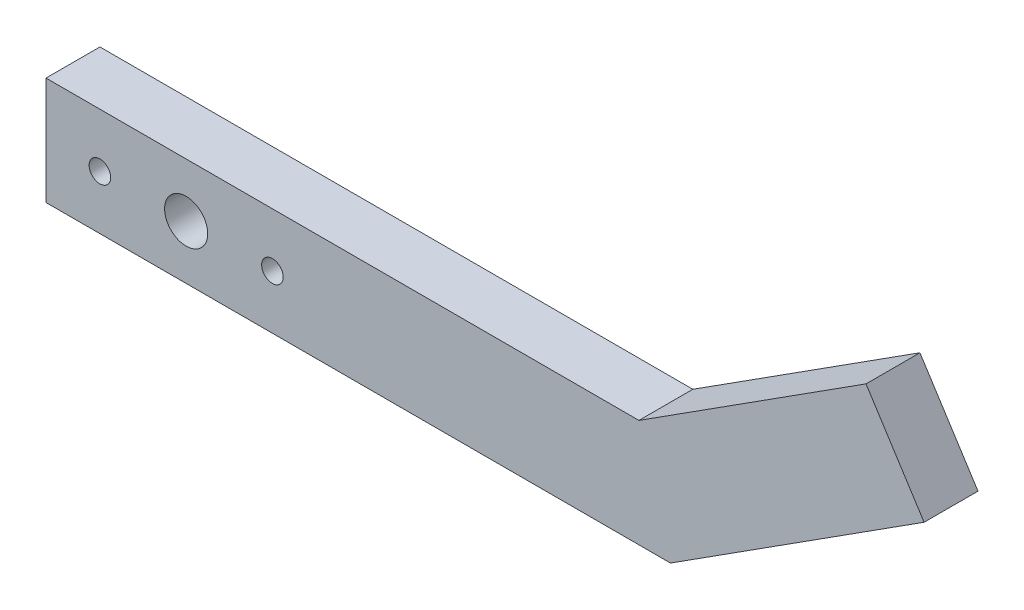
ISO-10303-21;
HEADER;
FILE_DESCRIPTION(('STEP AP214'),'2;1');
FILE_NAME('part.step','',(''),(''),'','','');
FILE_SCHEMA(('AUTOMOTIVE_DESIGN { 1 0 10303 214 1 1 1 1 }'));
ENDSEC;
DATA;
#1=APPLICATION_CONTEXT('core data for automotive mechanical design processes');
#2=APPLICATION_PROTOCOL_DEFINITION('international standard','automotive_design',2000,#1);
#3=PRODUCT_CONTEXT('',#1,'mechanical');
#4=PRODUCT('Part','Part','',(#3));
#5=PRODUCT_RELATED_PRODUCT_CATEGORY('part','',(#4));
#6=PRODUCT_DEFINITION_FORMATION('','',#4);
#7=PRODUCT_DEFINITION_CONTEXT('part definition',#1,'design');
#8=PRODUCT_DEFINITION('design','',#6,#7);
#9=PRODUCT_DEFINITION_SHAPE('','',#8);
#10=(LENGTH_UNIT() NAMED_UNIT(*) SI_UNIT(.MILLI.,.METRE.));
#11=(NAMED_UNIT(*) PLANE_ANGLE_UNIT() SI_UNIT($,.RADIAN.));
#12=(NAMED_UNIT(*) SI_UNIT($,.STERADIAN.) SOLID_ANGLE_UNIT());
#13=UNCERTAINTY_MEASURE_WITH_UNIT(LENGTH_MEASURE(1.E-05),#10,'distance_accuracy_value','');
#14=(GEOMETRIC_REPRESENTATION_CONTEXT(3) GLOBAL_UNCERTAINTY_ASSIGNED_CONTEXT((#13)) GLOBAL_UNIT_ASSIGNED_CONTEXT((#10,
#11,#12)) REPRESENTATION_CONTEXT('',''));
#15=CARTESIAN_POINT('',(0.,0.,0.));
#16=DIRECTION('',(0.,0.,1.));
#17=DIRECTION('',(1.,0.,0.));
#18=AXIS2_PLACEMENT_3D('',#15,#16,#17);
#19=CARTESIAN_POINT('',(-30.,5.,5.));
#20=DIRECTION('',(1.,0.,0.));
#21=DIRECTION('',(0.,0.,-1.));
#22=AXIS2_PLACEMENT_3D('',#19,#20,#21);
#23=PLANE('',#22);
#24=DIRECTION('',(0.,-1.,0.));
#25=VECTOR('',#24,1.);
#26=CARTESIAN_POINT('',(-30.,5.,0.));
#27=LINE('',#26,#25);
#28=CARTESIAN_POINT('',(-30.,5.,0.));
#29=VERTEX_POINT('',#28);
#30=CARTESIAN_POINT('',(-30.,-5.,0.));
#31=VERTEX_POINT('',#30);
#32=EDGE_CURVE('E121',#29,#31,#27,.T.);
#33=ORIENTED_EDGE('',*,*,#32,.T.);
#34=DIRECTION('',(0.,0.,-1.));
#35=VECTOR('',#34,1.);
#36=CARTESIAN_POINT('',(-30.,-5.,5.));
#37=LINE('',#36,#35);
#38=CARTESIAN_POINT('',(-30.,-5.,5.));
#39=VERTEX_POINT('',#38);
#40=EDGE_CURVE('E11',#39,#31,#37,.T.);
#41=ORIENTED_EDGE('',*,*,#40,.F.);
#42=DIRECTION('',(0.,-1.,0.));
#43=VECTOR('',#42,1.);
#44=CARTESIAN_POINT('',(-30.,5.,5.));
#45=LINE('',#44,#43);
#46=CARTESIAN_POINT('',(-30.,5.,5.));
#47=VERTEX_POINT('',#46);
#48=EDGE_CURVE('E132',#47,#39,#45,.T.);
#49=ORIENTED_EDGE('',*,*,#48,.F.);
#50=DIRECTION('',(0.,0.,-1.));
#51=VECTOR('',#50,1.);
#52=CARTESIAN_POINT('',(-30.,5.,5.));
#53=LINE('',#52,#51);
#54=EDGE_CURVE('E117',#47,#29,#53,.T.);
#55=ORIENTED_EDGE('',*,*,#54,.T.);
#56=EDGE_LOOP('',(#33,#41,#49,#55));
#57=FACE_BOUND('',#56,.T.);
#58=ADVANCED_FACE('F37',(#57),#23,.F.);
#59=CARTESIAN_POINT('',(20.,-5.,5.));
#60=DIRECTION('',(0.,1.,0.));
#61=DIRECTION('',(0.,0.,1.));
#62=AXIS2_PLACEMENT_3D('',#59,#60,#61);
#63=PLANE('',#62);
#64=DIRECTION('',(1.,0.,0.));
#65=VECTOR('',#64,1.);
#66=CARTESIAN_POINT('',(20.,-5.,0.));
#67=LINE('',#66,#65);
#68=CARTESIAN_POINT('',(27.9231229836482,-5.,0.));
#69=VERTEX_POINT('',#68);
#70=EDGE_CURVE('E124',#31,#69,#67,.T.);
#71=ORIENTED_EDGE('',*,*,#70,.T.);
#72=DIRECTION('',(0.,0.,-1.));
#73=VECTOR('',#72,1.);
#74=CARTESIAN_POINT('',(27.9231229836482,-5.,5.));
#75=LINE('',#74,#73);
#76=CARTESIAN_POINT('',(27.9231229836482,-5.,5.));
#77=VERTEX_POINT('',#76);
#78=EDGE_CURVE('E45',#77,#69,#75,.T.);
#79=ORIENTED_EDGE('',*,*,#78,.F.);
#80=DIRECTION('',(1.,0.,0.));
#81=VECTOR('',#80,1.);
#82=CARTESIAN_POINT('',(-30.,-5.,5.));
#83=LINE('',#82,#81);
#84=EDGE_CURVE('E90',#39,#77,#83,.T.);
#85=ORIENTED_EDGE('',*,*,#84,.F.);
#86=ORIENTED_EDGE('',*,*,#40,.T.);
#87=EDGE_LOOP('',(#71,#79,#85,#86));
#88=FACE_BOUND('',#87,.T.);
#89=ADVANCED_FACE('F157',(#88),#63,.F.);
#90=CARTESIAN_POINT('',(51.4500226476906,10.0394743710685,5.));
#91=DIRECTION('',(-0.538602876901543,0.842559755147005,0.));
#92=DIRECTION('',(-0.842559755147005,-0.538602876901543,0.));
#93=AXIS2_PLACEMENT_3D('',#90,#91,#92);
#94=PLANE('',#93);
#95=DIRECTION('',(0.842559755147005,0.538602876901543,0.));
#96=VECTOR('',#95,1.);
#97=CARTESIAN_POINT('',(51.4500226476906,10.0394743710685,0.));
#98=LINE('',#97,#96);
#99=CARTESIAN_POINT('',(51.4500226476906,10.0394743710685,0.));
#100=VERTEX_POINT('',#99);
#101=EDGE_CURVE('E127',#69,#100,#98,.T.);
#102=ORIENTED_EDGE('',*,*,#101,.T.);
#103=DIRECTION('',(0.,0.,-1.));
#104=VECTOR('',#103,1.);
#105=CARTESIAN_POINT('',(51.4500226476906,10.0394743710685,5.));
#106=LINE('',#105,#104);
#107=CARTESIAN_POINT('',(51.4500226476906,10.0394743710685,5.));
#108=VERTEX_POINT('',#107);
#109=EDGE_CURVE('E112',#108,#100,#106,.T.);
#110=ORIENTED_EDGE('',*,*,#109,.F.);
#111=DIRECTION('',(0.842559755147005,0.538602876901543,0.));
#112=VECTOR('',#111,1.);
#113=CARTESIAN_POINT('',(51.4500226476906,10.0394743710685,5.));
#114=LINE('',#113,#112);
#115=EDGE_CURVE('E103',#77,#108,#114,.T.);
#116=ORIENTED_EDGE('',*,*,#115,.F.);
#117=ORIENTED_EDGE('',*,*,#78,.T.);
#118=EDGE_LOOP('',(#102,#110,#116,#117));
#119=FACE_BOUND('',#118,.T.);
#120=ADVANCED_FACE('F138',(#119),#94,.F.);
#121=CARTESIAN_POINT('',(46.0639938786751,18.4650719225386,5.));
#122=DIRECTION('',(-0.842559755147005,-0.538602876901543,0.));
#123=DIRECTION('',(0.538602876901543,-0.842559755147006,0.));
#124=AXIS2_PLACEMENT_3D('',#121,#122,#123);
#125=PLANE('',#124);
#126=DIRECTION('',(-0.538602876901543,0.842559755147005,0.));
#127=VECTOR('',#126,1.);
#128=CARTESIAN_POINT('',(46.0639938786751,18.4650719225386,0.));
#129=LINE('',#128,#127);
#130=CARTESIAN_POINT('',(46.0639938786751,18.4650719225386,0.));
#131=VERTEX_POINT('',#130);
#132=EDGE_CURVE('E111',#100,#131,#129,.T.);
#133=ORIENTED_EDGE('',*,*,#132,.T.);
#134=DIRECTION('',(0.,0.,-1.));
#135=VECTOR('',#134,1.);
#136=CARTESIAN_POINT('',(46.0639938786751,18.4650719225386,5.));
#137=LINE('',#136,#135);
#138=CARTESIAN_POINT('',(46.0639938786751,18.4650719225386,5.));
#139=VERTEX_POINT('',#138);
#140=EDGE_CURVE('E108',#139,#131,#137,.T.);
#141=ORIENTED_EDGE('',*,*,#140,.F.);
#142=DIRECTION('',(-0.538602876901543,0.842559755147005,0.));
#143=VECTOR('',#142,1.);
#144=CARTESIAN_POINT('',(46.0639938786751,18.4650719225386,5.));
#145=LINE('',#144,#143);
#146=EDGE_CURVE('E97',#108,#139,#145,.T.);
#147=ORIENTED_EDGE('',*,*,#146,.F.);
#148=ORIENTED_EDGE('',*,*,#109,.T.);
#149=EDGE_LOOP('',(#133,#141,#147,#148));
#150=FACE_BOUND('',#149,.T.);
#151=ADVANCED_FACE('F109',(#150),#125,.F.);
#152=CARTESIAN_POINT('',(25.,5.,5.));
#153=DIRECTION('',(0.538602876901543,-0.842559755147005,0.));
#154=DIRECTION('',(0.842559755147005,0.538602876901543,0.));
#155=AXIS2_PLACEMENT_3D('',#152,#153,#154);
#156=PLANE('',#155);
#157=DIRECTION('',(-0.842559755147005,-0.538602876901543,0.));
#158=VECTOR('',#157,1.);
#159=CARTESIAN_POINT('',(25.,5.,0.));
#160=LINE('',#159,#158);
#161=CARTESIAN_POINT('',(25.,5.,0.));
#162=VERTEX_POINT('',#161);
#163=EDGE_CURVE('E76',#131,#162,#160,.T.);
#164=ORIENTED_EDGE('',*,*,#163,.T.);
#165=DIRECTION('',(0.,0.,-1.));
#166=VECTOR('',#165,1.);
#167=CARTESIAN_POINT('',(25.,5.,5.));
#168=LINE('',#167,#166);
#169=CARTESIAN_POINT('',(25.,5.,5.));
#170=VERTEX_POINT('',#169);
#171=EDGE_CURVE('E113',#170,#162,#168,.T.);
#172=ORIENTED_EDGE('',*,*,#171,.F.);
#173=DIRECTION('',(-0.842559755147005,-0.538602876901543,0.));
#174=VECTOR('',#173,1.);
#175=CARTESIAN_POINT('',(25.,5.,5.));
#176=LINE('',#175,#174);
#177=EDGE_CURVE('E101',#139,#170,#176,.T.);
#178=ORIENTED_EDGE('',*,*,#177,.F.);
#179=ORIENTED_EDGE('',*,*,#140,.T.);
#180=EDGE_LOOP('',(#164,#172,#178,#179));
#181=FACE_BOUND('',#180,.T.);
#182=ADVANCED_FACE('F115',(#181),#156,.F.);
#183=CARTESIAN_POINT('',(-30.,5.,5.));
#184=DIRECTION('',(0.,-1.,0.));
#185=DIRECTION('',(0.,0.,-1.));
#186=AXIS2_PLACEMENT_3D('',#183,#184,#185);
#187=PLANE('',#186);
#188=DIRECTION('',(-1.,0.,0.));
#189=VECTOR('',#188,1.);
#190=CARTESIAN_POINT('',(-30.,5.,0.));
#191=LINE('',#190,#189);
#192=EDGE_CURVE('E82',#162,#29,#191,.T.);
#193=ORIENTED_EDGE('',*,*,#192,.T.);
#194=ORIENTED_EDGE('',*,*,#54,.F.);
#195=DIRECTION('',(-1.,0.,0.));
#196=VECTOR('',#195,1.);
#197=CARTESIAN_POINT('',(-30.,5.,5.));
#198=LINE('',#197,#196);
#199=EDGE_CURVE('E53',#170,#47,#198,.T.);
#200=ORIENTED_EDGE('',*,*,#199,.F.);
#201=ORIENTED_EDGE('',*,*,#171,.T.);
#202=EDGE_LOOP('',(#193,#194,#200,#201));
#203=FACE_BOUND('',#202,.T.);
#204=ADVANCED_FACE('F145',(#203),#187,.F.);
#205=CARTESIAN_POINT('',(0.,0.,5.));
#206=DIRECTION('',(0.,0.,1.));
#207=DIRECTION('',(1.,0.,0.));
#208=AXIS2_PLACEMENT_3D('',#205,#206,#207);
#209=PLANE('',#208);
#210=CARTESIAN_POINT('',(-9.,0.,5.));
#211=DIRECTION('',(0.,0.,1.));
#212=DIRECTION('',(1.,0.,0.));
#213=AXIS2_PLACEMENT_3D('',#210,#211,#212);
#214=CIRCLE('',#213,1.);
#215=CARTESIAN_POINT('',(-8.,0.,5.));
#216=VERTEX_POINT('',#215);
#217=EDGE_CURVE('E233',#216,#216,#214,.T.);
#218=ORIENTED_EDGE('',*,*,#217,.F.);
#219=EDGE_LOOP('',(#218));
#220=FACE_BOUND('',#219,.T.);
#221=CARTESIAN_POINT('',(-25.,0.,5.));
#222=DIRECTION('',(0.,0.,1.));
#223=DIRECTION('',(1.,0.,0.));
#224=AXIS2_PLACEMENT_3D('',#221,#222,#223);
#225=CIRCLE('',#224,1.);
#226=CARTESIAN_POINT('',(-24.,0.,5.));
#227=VERTEX_POINT('',#226);
#228=EDGE_CURVE('E235',#227,#227,#225,.T.);
#229=ORIENTED_EDGE('',*,*,#228,.F.);
#230=EDGE_LOOP('',(#229));
#231=FACE_BOUND('',#230,.T.);
#232=CARTESIAN_POINT('',(-17.,0.,5.));
#233=DIRECTION('',(0.,0.,1.));
#234=DIRECTION('',(1.,0.,0.));
#235=AXIS2_PLACEMENT_3D('',#232,#233,#234);
#236=CIRCLE('',#235,2.);
#237=CARTESIAN_POINT('',(-15.,0.,5.));
#238=VERTEX_POINT('',#237);
#239=EDGE_CURVE('E241',#238,#238,#236,.T.);
#240=ORIENTED_EDGE('',*,*,#239,.F.);
#241=EDGE_LOOP('',(#240));
#242=FACE_BOUND('',#241,.T.);
#243=ORIENTED_EDGE('',*,*,#48,.T.);
#244=ORIENTED_EDGE('',*,*,#84,.T.);
#245=ORIENTED_EDGE('',*,*,#115,.T.);
#246=ORIENTED_EDGE('',*,*,#146,.T.);
#247=ORIENTED_EDGE('',*,*,#177,.T.);
#248=ORIENTED_EDGE('',*,*,#199,.T.);
#249=EDGE_LOOP('',(#243,#244,#245,#246,#247,#248));
#250=FACE_BOUND('',#249,.T.);
#251=ADVANCED_FACE('F99',(#220,#231,#242,#250),#209,.T.);
#252=CARTESIAN_POINT('',(0.,0.,0.));
#253=DIRECTION('',(0.,0.,1.));
#254=DIRECTION('',(1.,0.,0.));
#255=AXIS2_PLACEMENT_3D('',#252,#253,#254);
#256=PLANE('',#255);
#257=CARTESIAN_POINT('',(-9.,0.,0.));
#258=DIRECTION('',(0.,0.,1.));
#259=DIRECTION('',(1.,0.,0.));
#260=AXIS2_PLACEMENT_3D('',#257,#258,#259);
#261=CIRCLE('',#260,1.);
#262=CARTESIAN_POINT('',(-8.,0.,0.));
#263=VERTEX_POINT('',#262);
#264=EDGE_CURVE('E230',#263,#263,#261,.T.);
#265=ORIENTED_EDGE('',*,*,#264,.T.);
#266=EDGE_LOOP('',(#265));
#267=FACE_BOUND('',#266,.T.);
#268=CARTESIAN_POINT('',(-25.,0.,0.));
#269=DIRECTION('',(0.,0.,1.));
#270=DIRECTION('',(1.,0.,0.));
#271=AXIS2_PLACEMENT_3D('',#268,#269,#270);
#272=CIRCLE('',#271,1.);
#273=CARTESIAN_POINT('',(-24.,0.,0.));
#274=VERTEX_POINT('',#273);
#275=EDGE_CURVE('E238',#274,#274,#272,.T.);
#276=ORIENTED_EDGE('',*,*,#275,.T.);
#277=EDGE_LOOP('',(#276));
#278=FACE_BOUND('',#277,.T.);
#279=CARTESIAN_POINT('',(-17.,0.,0.));
#280=DIRECTION('',(0.,0.,1.));
#281=DIRECTION('',(1.,0.,0.));
#282=AXIS2_PLACEMENT_3D('',#279,#280,#281);
#283=CIRCLE('',#282,2.);
#284=CARTESIAN_POINT('',(-15.,0.,0.));
#285=VERTEX_POINT('',#284);
#286=EDGE_CURVE('E125',#285,#285,#283,.T.);
#287=ORIENTED_EDGE('',*,*,#286,.T.);
#288=EDGE_LOOP('',(#287));
#289=FACE_BOUND('',#288,.T.);
#290=ORIENTED_EDGE('',*,*,#32,.F.);
#291=ORIENTED_EDGE('',*,*,#192,.F.);
#292=ORIENTED_EDGE('',*,*,#163,.F.);
#293=ORIENTED_EDGE('',*,*,#132,.F.);
#294=ORIENTED_EDGE('',*,*,#101,.F.);
#295=ORIENTED_EDGE('',*,*,#70,.F.);
#296=EDGE_LOOP('',(#290,#291,#292,#293,#294,#295));
#297=FACE_BOUND('',#296,.T.);
#298=ADVANCED_FACE('F141',(#267,#278,#289,#297),#256,.F.);
#299=CARTESIAN_POINT('',(-17.,0.,0.));
#300=DIRECTION('',(0.,0.,1.));
#301=DIRECTION('',(1.,0.,0.));
#302=AXIS2_PLACEMENT_3D('',#299,#300,#301);
#303=CYLINDRICAL_SURFACE('',#302,2.);
#304=ORIENTED_EDGE('',*,*,#286,.F.);
#305=EDGE_LOOP('',(#304));
#306=FACE_BOUND('',#305,.T.);
#307=ORIENTED_EDGE('',*,*,#239,.T.);
#308=EDGE_LOOP('',(#307));
#309=FACE_BOUND('',#308,.T.);
#310=ADVANCED_FACE('F194',(#306,#309),#303,.F.);
#311=CARTESIAN_POINT('',(-25.,0.,0.));
#312=DIRECTION('',(0.,0.,1.));
#313=DIRECTION('',(1.,0.,0.));
#314=AXIS2_PLACEMENT_3D('',#311,#312,#313);
#315=CYLINDRICAL_SURFACE('',#314,1.);
#316=ORIENTED_EDGE('',*,*,#275,.F.);
#317=EDGE_LOOP('',(#316));
#318=FACE_BOUND('',#317,.T.);
#319=ORIENTED_EDGE('',*,*,#228,.T.);
#320=EDGE_LOOP('',(#319));
#321=FACE_BOUND('',#320,.T.);
#322=ADVANCED_FACE('F203',(#318,#321),#315,.F.);
#323=CARTESIAN_POINT('',(-9.,0.,0.));
#324=DIRECTION('',(0.,0.,1.));
#325=DIRECTION('',(1.,0.,0.));
#326=AXIS2_PLACEMENT_3D('',#323,#324,#325);
#327=CYLINDRICAL_SURFACE('',#326,1.);
#328=ORIENTED_EDGE('',*,*,#264,.F.);
#329=EDGE_LOOP('',(#328));
#330=FACE_BOUND('',#329,.T.);
#331=ORIENTED_EDGE('',*,*,#217,.T.);
#332=EDGE_LOOP('',(#331));
#333=FACE_BOUND('',#332,.T.);
#334=ADVANCED_FACE('F213',(#330,#333),#327,.F.);
#335=CLOSED_SHELL('',(#58,#89,#120,#151,#182,#204,#251,#298,#310,#322,#334));
#336=MANIFOLD_SOLID_BREP('B2',#335);
#337=ADVANCED_BREP_SHAPE_REPRESENTATION('',(#18,#336),#14);
#338=SHAPE_DEFINITION_REPRESENTATION(#9,#337);
ENDSEC;
END-ISO-10303-21;
